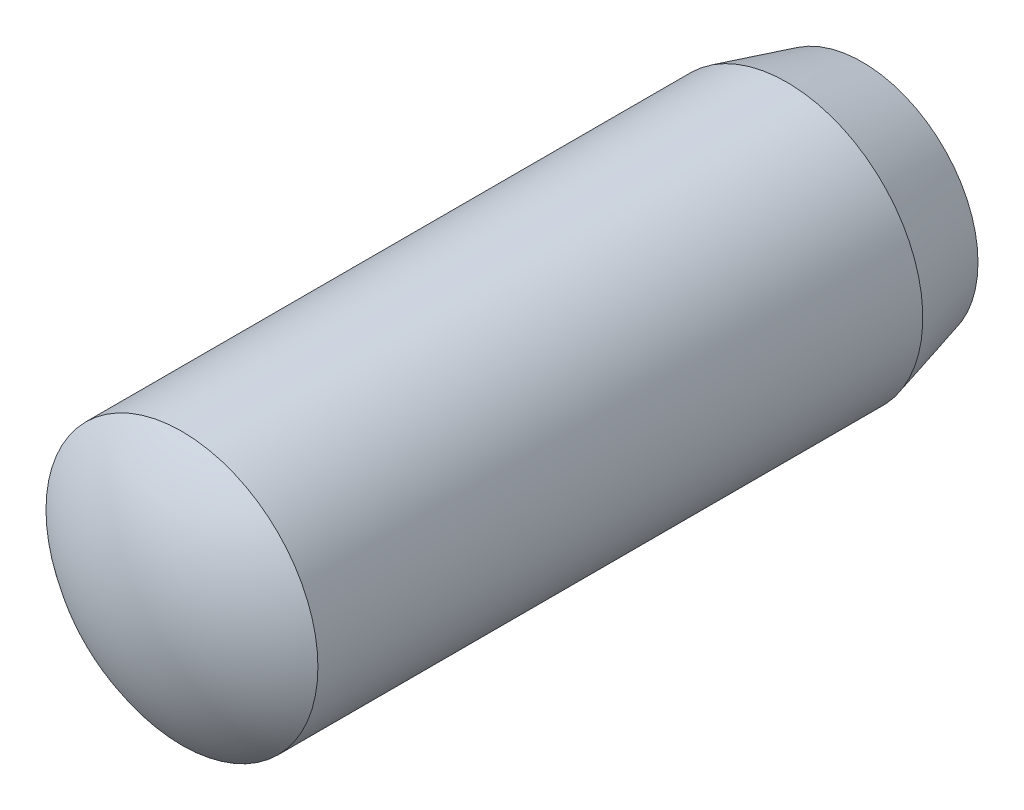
ISO-10303-21;
HEADER;
FILE_DESCRIPTION(('STEP AP214'),'2;1');
FILE_NAME('part.step','',(''),(''),'','','');
FILE_SCHEMA(('AUTOMOTIVE_DESIGN { 1 0 10303 214 1 1 1 1 }'));
ENDSEC;
DATA;
#1=APPLICATION_CONTEXT('core data for automotive mechanical design processes');
#2=APPLICATION_PROTOCOL_DEFINITION('international standard','automotive_design',2000,#1);
#3=PRODUCT_CONTEXT('',#1,'mechanical');
#4=PRODUCT('Part','Part','',(#3));
#5=PRODUCT_RELATED_PRODUCT_CATEGORY('part','',(#4));
#6=PRODUCT_DEFINITION_FORMATION('','',#4);
#7=PRODUCT_DEFINITION_CONTEXT('part definition',#1,'design');
#8=PRODUCT_DEFINITION('design','',#6,#7);
#9=PRODUCT_DEFINITION_SHAPE('','',#8);
#10=(LENGTH_UNIT() NAMED_UNIT(*) SI_UNIT(.MILLI.,.METRE.));
#11=(NAMED_UNIT(*) PLANE_ANGLE_UNIT() SI_UNIT($,.RADIAN.));
#12=(NAMED_UNIT(*) SI_UNIT($,.STERADIAN.) SOLID_ANGLE_UNIT());
#13=UNCERTAINTY_MEASURE_WITH_UNIT(LENGTH_MEASURE(1.E-05),#10,'distance_accuracy_value','');
#14=(GEOMETRIC_REPRESENTATION_CONTEXT(3) GLOBAL_UNCERTAINTY_ASSIGNED_CONTEXT((#13)) GLOBAL_UNIT_ASSIGNED_CONTEXT((#10,
#11,#12)) REPRESENTATION_CONTEXT('',''));
#15=CARTESIAN_POINT('',(0.,0.,0.));
#16=DIRECTION('',(0.,0.,1.));
#17=DIRECTION('',(1.,0.,0.));
#18=AXIS2_PLACEMENT_3D('',#15,#16,#17);
#19=CARTESIAN_POINT('',(0.,0.,-7.));
#20=DIRECTION('',(0.,0.,1.));
#21=DIRECTION('',(1.,0.,0.));
#22=AXIS2_PLACEMENT_3D('',#19,#20,#21);
#23=CONICAL_SURFACE('',#22,1.96410161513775,0.26179938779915);
#24=CARTESIAN_POINT('',(0.,0.,-5.));
#25=DIRECTION('',(0.,0.,-1.));
#26=DIRECTION('',(-1.,0.,0.));
#27=AXIS2_PLACEMENT_3D('',#24,#25,#26);
#28=CIRCLE('',#27,2.5);
#29=CARTESIAN_POINT('',(-2.5,0.,-5.));
#30=VERTEX_POINT('',#29);
#31=EDGE_CURVE('E11',#30,#30,#28,.T.);
#32=ORIENTED_EDGE('',*,*,#31,.T.);
#33=EDGE_LOOP('',(#32));
#34=FACE_BOUND('',#33,.T.);
#35=CARTESIAN_POINT('',(0.,0.,-6.38670500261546));
#36=DIRECTION('',(0.,0.,-1.));
#37=DIRECTION('',(-1.,0.,0.));
#38=AXIS2_PLACEMENT_3D('',#35,#36,#37);
#39=CIRCLE('',#38,2.12843351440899);
#40=CARTESIAN_POINT('',(-2.12843351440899,0.,-6.38670500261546));
#41=VERTEX_POINT('',#40);
#42=EDGE_CURVE('E46',#41,#41,#39,.T.);
#43=ORIENTED_EDGE('',*,*,#42,.F.);
#44=EDGE_LOOP('',(#43));
#45=FACE_BOUND('',#44,.T.);
#46=ADVANCED_FACE('F38',(#34,#45),#23,.T.);
#47=CARTESIAN_POINT('',(0.,0.,7.));
#48=DIRECTION('',(0.,0.,-1.));
#49=DIRECTION('',(-1.,0.,0.));
#50=AXIS2_PLACEMENT_3D('',#47,#48,#49);
#51=CYLINDRICAL_SURFACE('',#50,2.5);
#52=CARTESIAN_POINT('',(0.,0.,6.1224989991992));
#53=DIRECTION('',(0.,0.,1.));
#54=DIRECTION('',(1.,0.,0.));
#55=AXIS2_PLACEMENT_3D('',#52,#53,#54);
#56=CIRCLE('',#55,2.5);
#57=CARTESIAN_POINT('',(2.5,0.,6.1224989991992));
#58=VERTEX_POINT('',#57);
#59=EDGE_CURVE('E59',#58,#58,#56,.T.);
#60=ORIENTED_EDGE('',*,*,#59,.F.);
#61=EDGE_LOOP('',(#60));
#62=FACE_BOUND('',#61,.T.);
#63=ORIENTED_EDGE('',*,*,#31,.F.);
#64=EDGE_LOOP('',(#63));
#65=FACE_BOUND('',#64,.T.);
#66=ADVANCED_FACE('F40',(#62,#65),#51,.T.);
#67=CARTESIAN_POINT('',(0.,0.,-3.));
#68=DIRECTION('',(0.,0.,-1.));
#69=DIRECTION('',(-1.,0.,0.));
#70=AXIS2_PLACEMENT_3D('',#67,#68,#69);
#71=SPHERICAL_SURFACE('',#70,4.);
#72=CARTESIAN_POINT('',(0.,0.,-7.));
#73=VERTEX_POINT('',#72);
#74=VERTEX_LOOP('',#73);
#75=FACE_BOUND('',#74,.T.);
#76=ORIENTED_EDGE('',*,*,#42,.T.);
#77=EDGE_LOOP('',(#76));
#78=FACE_BOUND('',#77,.T.);
#79=ADVANCED_FACE('F55',(#75,#78),#71,.T.);
#80=CARTESIAN_POINT('',(0.,0.,3.));
#81=DIRECTION('',(0.,0.,1.));
#82=DIRECTION('',(-1.,0.,0.));
#83=AXIS2_PLACEMENT_3D('',#80,#81,#82);
#84=SPHERICAL_SURFACE('',#83,4.);
#85=CARTESIAN_POINT('',(0.,0.,7.));
#86=VERTEX_POINT('',#85);
#87=VERTEX_LOOP('',#86);
#88=FACE_BOUND('',#87,.T.);
#89=ORIENTED_EDGE('',*,*,#59,.T.);
#90=EDGE_LOOP('',(#89));
#91=FACE_BOUND('',#90,.T.);
#92=ADVANCED_FACE('F52',(#88,#91),#84,.T.);
#93=CLOSED_SHELL('',(#46,#66,#79,#92));
#94=MANIFOLD_SOLID_BREP('B2',#93);
#95=ADVANCED_BREP_SHAPE_REPRESENTATION('',(#18,#94),#14);
#96=SHAPE_DEFINITION_REPRESENTATION(#9,#95);
ENDSEC;
END-ISO-10303-21;
